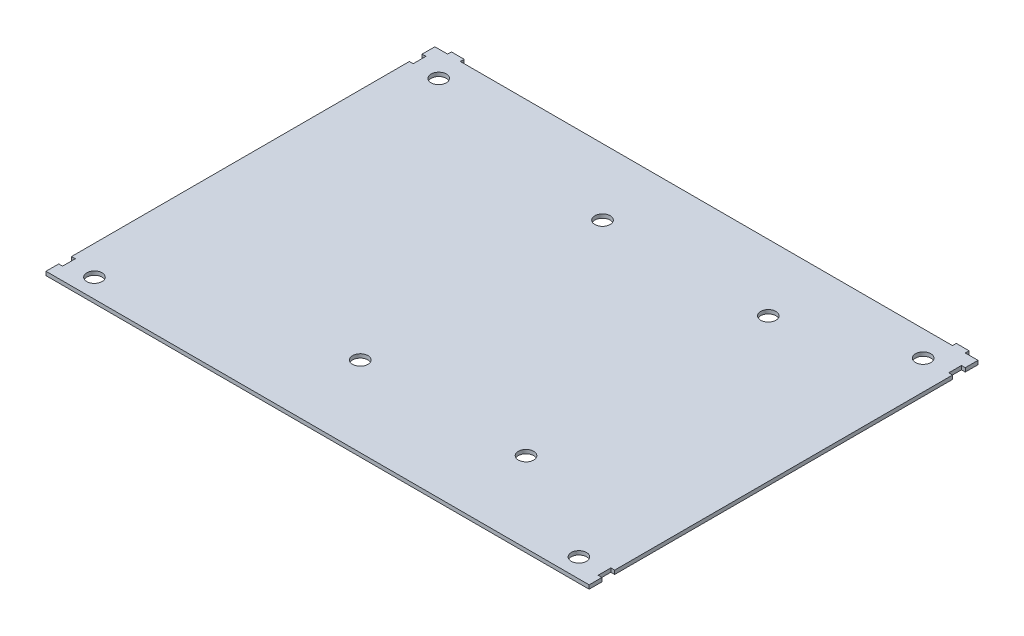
ISO-10303-21;
HEADER;
FILE_DESCRIPTION(('STEP AP214'),'2;1');
FILE_NAME('part.step','',(''),(''),'','','');
FILE_SCHEMA(('AUTOMOTIVE_DESIGN { 1 0 10303 214 1 1 1 1 }'));
ENDSEC;
DATA;
#1=APPLICATION_CONTEXT('core data for automotive mechanical design processes');
#2=APPLICATION_PROTOCOL_DEFINITION('international standard','automotive_design',2000,#1);
#3=PRODUCT_CONTEXT('',#1,'mechanical');
#4=PRODUCT('Part','Part','',(#3));
#5=PRODUCT_RELATED_PRODUCT_CATEGORY('part','',(#4));
#6=PRODUCT_DEFINITION_FORMATION('','',#4);
#7=PRODUCT_DEFINITION_CONTEXT('part definition',#1,'design');
#8=PRODUCT_DEFINITION('design','',#6,#7);
#9=PRODUCT_DEFINITION_SHAPE('','',#8);
#10=(LENGTH_UNIT() NAMED_UNIT(*) SI_UNIT(.MILLI.,.METRE.));
#11=(NAMED_UNIT(*) PLANE_ANGLE_UNIT() SI_UNIT($,.RADIAN.));
#12=(NAMED_UNIT(*) SI_UNIT($,.STERADIAN.) SOLID_ANGLE_UNIT());
#13=UNCERTAINTY_MEASURE_WITH_UNIT(LENGTH_MEASURE(1.E-05),#10,'distance_accuracy_value','');
#14=(GEOMETRIC_REPRESENTATION_CONTEXT(3) GLOBAL_UNCERTAINTY_ASSIGNED_CONTEXT((#13)) GLOBAL_UNIT_ASSIGNED_CONTEXT((#10,
#11,#12)) REPRESENTATION_CONTEXT('',''));
#15=CARTESIAN_POINT('',(0.,0.,0.));
#16=DIRECTION('',(0.,0.,1.));
#17=DIRECTION('',(1.,0.,0.));
#18=AXIS2_PLACEMENT_3D('',#15,#16,#17);
#19=CARTESIAN_POINT('',(214.,0.,-297.));
#20=DIRECTION('',(0.,0.,1.));
#21=DIRECTION('',(1.,0.,0.));
#22=AXIS2_PLACEMENT_3D('',#19,#20,#21);
#23=PLANE('',#22);
#24=DIRECTION('',(1.,0.,0.));
#25=VECTOR('',#24,1.);
#26=CARTESIAN_POINT('',(214.,3.,-297.));
#27=LINE('',#26,#25);
#28=CARTESIAN_POINT('',(214.,3.,-297.));
#29=VERTEX_POINT('',#28);
#30=CARTESIAN_POINT('',(224.,3.,-297.));
#31=VERTEX_POINT('',#30);
#32=EDGE_CURVE('E245',#29,#31,#27,.T.);
#33=ORIENTED_EDGE('',*,*,#32,.T.);
#34=DIRECTION('',(0.,1.,0.));
#35=VECTOR('',#34,1.);
#36=CARTESIAN_POINT('',(224.,-10.4403065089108,-297.));
#37=LINE('',#36,#35);
#38=CARTESIAN_POINT('',(224.,0.,-297.));
#39=VERTEX_POINT('',#38);
#40=EDGE_CURVE('E226',#39,#31,#37,.T.);
#41=ORIENTED_EDGE('',*,*,#40,.F.);
#42=DIRECTION('',(1.,0.,0.));
#43=VECTOR('',#42,1.);
#44=CARTESIAN_POINT('',(214.,0.,-297.));
#45=LINE('',#44,#43);
#46=CARTESIAN_POINT('',(214.,0.,-297.));
#47=VERTEX_POINT('',#46);
#48=EDGE_CURVE('E258',#47,#39,#45,.T.);
#49=ORIENTED_EDGE('',*,*,#48,.F.);
#50=DIRECTION('',(0.,1.,0.));
#51=VECTOR('',#50,1.);
#52=CARTESIAN_POINT('',(214.,0.,-297.));
#53=LINE('',#52,#51);
#54=EDGE_CURVE('E252',#47,#29,#53,.T.);
#55=ORIENTED_EDGE('',*,*,#54,.T.);
#56=EDGE_LOOP('',(#33,#41,#49,#55));
#57=FACE_BOUND('',#56,.T.);
#58=ADVANCED_FACE('F39',(#57),#23,.F.);
#59=CARTESIAN_POINT('',(234.,0.,-297.));
#60=VERTEX_POINT('',#59);
#61=CARTESIAN_POINT('',(620.,0.,-297.));
#62=VERTEX_POINT('',#61);
#63=EDGE_CURVE('E256',#60,#62,#45,.T.);
#64=ORIENTED_EDGE('',*,*,#63,.F.);
#65=DIRECTION('',(0.,1.,0.));
#66=VECTOR('',#65,1.);
#67=CARTESIAN_POINT('',(234.,-10.4403065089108,-297.));
#68=LINE('',#67,#66);
#69=CARTESIAN_POINT('',(234.,3.,-297.));
#70=VERTEX_POINT('',#69);
#71=EDGE_CURVE('E56',#60,#70,#68,.T.);
#72=ORIENTED_EDGE('',*,*,#71,.T.);
#73=CARTESIAN_POINT('',(620.,3.,-297.));
#74=VERTEX_POINT('',#73);
#75=EDGE_CURVE('E253',#70,#74,#27,.T.);
#76=ORIENTED_EDGE('',*,*,#75,.T.);
#77=DIRECTION('',(0.,1.,0.));
#78=VECTOR('',#77,1.);
#79=CARTESIAN_POINT('',(620.,-10.4403065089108,-297.));
#80=LINE('',#79,#78);
#81=EDGE_CURVE('E290',#62,#74,#80,.T.);
#82=ORIENTED_EDGE('',*,*,#81,.F.);
#83=EDGE_LOOP('',(#64,#72,#76,#82));
#84=FACE_BOUND('',#83,.T.);
#85=ADVANCED_FACE('F291',(#84),#23,.F.);
#86=CARTESIAN_POINT('',(214.,429.075110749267,0.));
#87=DIRECTION('',(-1.,0.,0.));
#88=DIRECTION('',(0.,0.,1.));
#89=AXIS2_PLACEMENT_3D('',#86,#87,#88);
#90=PLANE('',#89);
#91=DIRECTION('',(0.,-1.,0.));
#92=VECTOR('',#91,1.);
#93=CARTESIAN_POINT('',(214.,3.,-277.));
#94=LINE('',#93,#92);
#95=CARTESIAN_POINT('',(214.,3.,-277.));
#96=VERTEX_POINT('',#95);
#97=CARTESIAN_POINT('',(214.,0.,-277.));
#98=VERTEX_POINT('',#97);
#99=EDGE_CURVE('E260',#96,#98,#94,.T.);
#100=ORIENTED_EDGE('',*,*,#99,.T.);
#101=DIRECTION('',(0.,0.,-1.));
#102=VECTOR('',#101,1.);
#103=CARTESIAN_POINT('',(214.,0.,0.));
#104=LINE('',#103,#102);
#105=CARTESIAN_POINT('',(214.,0.,-12.));
#106=VERTEX_POINT('',#105);
#107=EDGE_CURVE('E338',#106,#98,#104,.T.);
#108=ORIENTED_EDGE('',*,*,#107,.F.);
#109=DIRECTION('',(0.,1.,0.));
#110=VECTOR('',#109,1.);
#111=CARTESIAN_POINT('',(214.,0.,-12.));
#112=LINE('',#111,#110);
#113=CARTESIAN_POINT('',(214.,3.,-12.));
#114=VERTEX_POINT('',#113);
#115=EDGE_CURVE('E348',#106,#114,#112,.T.);
#116=ORIENTED_EDGE('',*,*,#115,.T.);
#117=DIRECTION('',(0.,0.,-1.));
#118=VECTOR('',#117,1.);
#119=CARTESIAN_POINT('',(214.,3.,0.));
#120=LINE('',#119,#118);
#121=EDGE_CURVE('E356',#114,#96,#120,.T.);
#122=ORIENTED_EDGE('',*,*,#121,.T.);
#123=EDGE_LOOP('',(#100,#108,#116,#122));
#124=FACE_BOUND('',#123,.T.);
#125=ADVANCED_FACE('F487',(#124),#90,.T.);
#126=DIRECTION('',(0.,-1.,0.));
#127=VECTOR('',#126,1.);
#128=CARTESIAN_POINT('',(214.,3.,-287.));
#129=LINE('',#128,#127);
#130=CARTESIAN_POINT('',(214.,3.,-287.));
#131=VERTEX_POINT('',#130);
#132=CARTESIAN_POINT('',(214.,0.,-287.));
#133=VERTEX_POINT('',#132);
#134=EDGE_CURVE('E277',#131,#133,#129,.T.);
#135=ORIENTED_EDGE('',*,*,#134,.F.);
#136=EDGE_CURVE('E357',#131,#29,#120,.T.);
#137=ORIENTED_EDGE('',*,*,#136,.T.);
#138=ORIENTED_EDGE('',*,*,#54,.F.);
#139=EDGE_CURVE('E344',#133,#47,#104,.T.);
#140=ORIENTED_EDGE('',*,*,#139,.F.);
#141=EDGE_LOOP('',(#135,#137,#138,#140));
#142=FACE_BOUND('',#141,.T.);
#143=ADVANCED_FACE('F514',(#142),#90,.T.);
#144=CARTESIAN_POINT('',(640.,-319.530906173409,-300.));
#145=DIRECTION('',(1.,0.,0.));
#146=DIRECTION('',(0.,0.,-1.));
#147=AXIS2_PLACEMENT_3D('',#144,#145,#146);
#148=PLANE('',#147);
#149=DIRECTION('',(0.,-1.,0.));
#150=VECTOR('',#149,1.);
#151=CARTESIAN_POINT('',(640.,3.,-12.));
#152=LINE('',#151,#150);
#153=CARTESIAN_POINT('',(640.,3.,-12.));
#154=VERTEX_POINT('',#153);
#155=CARTESIAN_POINT('',(640.,0.,-12.));
#156=VERTEX_POINT('',#155);
#157=EDGE_CURVE('E383',#154,#156,#152,.T.);
#158=ORIENTED_EDGE('',*,*,#157,.T.);
#159=DIRECTION('',(0.,0.,1.));
#160=VECTOR('',#159,1.);
#161=CARTESIAN_POINT('',(640.,0.,-300.));
#162=LINE('',#161,#160);
#163=CARTESIAN_POINT('',(640.,0.,-277.));
#164=VERTEX_POINT('',#163);
#165=EDGE_CURVE('E48',#164,#156,#162,.T.);
#166=ORIENTED_EDGE('',*,*,#165,.F.);
#167=DIRECTION('',(0.,-1.,0.));
#168=VECTOR('',#167,1.);
#169=CARTESIAN_POINT('',(640.,3.,-277.));
#170=LINE('',#169,#168);
#171=CARTESIAN_POINT('',(640.,3.,-277.));
#172=VERTEX_POINT('',#171);
#173=EDGE_CURVE('E402',#172,#164,#170,.T.);
#174=ORIENTED_EDGE('',*,*,#173,.F.);
#175=DIRECTION('',(0.,0.,-1.));
#176=VECTOR('',#175,1.);
#177=CARTESIAN_POINT('',(640.,3.,-300.));
#178=LINE('',#177,#176);
#179=EDGE_CURVE('E587',#154,#172,#178,.T.);
#180=ORIENTED_EDGE('',*,*,#179,.F.);
#181=EDGE_LOOP('',(#158,#166,#174,#180));
#182=FACE_BOUND('',#181,.T.);
#183=ADVANCED_FACE('F478',(#182),#148,.T.);
#184=DIRECTION('',(0.,1.,0.));
#185=VECTOR('',#184,1.);
#186=CARTESIAN_POINT('',(640.,0.,-297.));
#187=LINE('',#186,#185);
#188=CARTESIAN_POINT('',(640.,0.,-297.));
#189=VERTEX_POINT('',#188);
#190=CARTESIAN_POINT('',(640.,3.,-297.));
#191=VERTEX_POINT('',#190);
#192=EDGE_CURVE('E280',#189,#191,#187,.T.);
#193=ORIENTED_EDGE('',*,*,#192,.T.);
#194=CARTESIAN_POINT('',(640.,3.,-287.));
#195=VERTEX_POINT('',#194);
#196=EDGE_CURVE('E464',#195,#191,#178,.T.);
#197=ORIENTED_EDGE('',*,*,#196,.F.);
#198=DIRECTION('',(0.,-1.,0.));
#199=VECTOR('',#198,1.);
#200=CARTESIAN_POINT('',(640.,3.,-287.));
#201=LINE('',#200,#199);
#202=CARTESIAN_POINT('',(640.,0.,-287.));
#203=VERTEX_POINT('',#202);
#204=EDGE_CURVE('E410',#195,#203,#201,.T.);
#205=ORIENTED_EDGE('',*,*,#204,.T.);
#206=EDGE_CURVE('E11',#189,#203,#162,.T.);
#207=ORIENTED_EDGE('',*,*,#206,.F.);
#208=EDGE_LOOP('',(#193,#197,#205,#207));
#209=FACE_BOUND('',#208,.T.);
#210=ADVANCED_FACE('F471',(#209),#148,.T.);
#211=CARTESIAN_POINT('',(0.,3.,0.));
#212=DIRECTION('',(0.,1.,0.));
#213=DIRECTION('',(0.,0.,1.));
#214=AXIS2_PLACEMENT_3D('',#211,#212,#213);
#215=PLANE('',#214);
#216=DIRECTION('',(-1.,0.,0.));
#217=VECTOR('',#216,1.);
#218=CARTESIAN_POINT('',(214.,3.,-277.));
#219=LINE('',#218,#217);
#220=CARTESIAN_POINT('',(217.,3.,-277.));
#221=VERTEX_POINT('',#220);
#222=EDGE_CURVE('E278',#221,#96,#219,.T.);
#223=ORIENTED_EDGE('',*,*,#222,.T.);
#224=ORIENTED_EDGE('',*,*,#121,.F.);
#225=DIRECTION('',(-1.,0.,0.));
#226=VECTOR('',#225,1.);
#227=CARTESIAN_POINT('',(214.,3.,-12.));
#228=LINE('',#227,#226);
#229=CARTESIAN_POINT('',(217.,3.,-12.));
#230=VERTEX_POINT('',#229);
#231=EDGE_CURVE('E611',#230,#114,#228,.T.);
#232=ORIENTED_EDGE('',*,*,#231,.F.);
#233=DIRECTION('',(0.,0.,-1.));
#234=VECTOR('',#233,1.);
#235=CARTESIAN_POINT('',(217.,3.,-12.));
#236=LINE('',#235,#234);
#237=CARTESIAN_POINT('',(217.,3.,-2.));
#238=VERTEX_POINT('',#237);
#239=EDGE_CURVE('E604',#238,#230,#236,.T.);
#240=ORIENTED_EDGE('',*,*,#239,.F.);
#241=DIRECTION('',(1.,0.,0.));
#242=VECTOR('',#241,1.);
#243=CARTESIAN_POINT('',(214.,3.,-2.));
#244=LINE('',#243,#242);
#245=CARTESIAN_POINT('',(214.,3.,-2.));
#246=VERTEX_POINT('',#245);
#247=EDGE_CURVE('E603',#246,#238,#244,.T.);
#248=ORIENTED_EDGE('',*,*,#247,.F.);
#249=CARTESIAN_POINT('',(214.,3.,8.));
#250=VERTEX_POINT('',#249);
#251=EDGE_CURVE('E352',#250,#246,#120,.T.);
#252=ORIENTED_EDGE('',*,*,#251,.F.);
#253=DIRECTION('',(-1.,0.,0.));
#254=VECTOR('',#253,1.);
#255=CARTESIAN_POINT('',(214.,3.,8.));
#256=LINE('',#255,#254);
#257=CARTESIAN_POINT('',(640.,3.,8.));
#258=VERTEX_POINT('',#257);
#259=EDGE_CURVE('E358',#258,#250,#256,.T.);
#260=ORIENTED_EDGE('',*,*,#259,.F.);
#261=CARTESIAN_POINT('',(640.,3.,-2.));
#262=VERTEX_POINT('',#261);
#263=EDGE_CURVE('E43',#258,#262,#178,.T.);
#264=ORIENTED_EDGE('',*,*,#263,.T.);
#265=DIRECTION('',(-1.,0.,0.));
#266=VECTOR('',#265,1.);
#267=CARTESIAN_POINT('',(640.,3.,-2.));
#268=LINE('',#267,#266);
#269=CARTESIAN_POINT('',(637.,3.,-2.00000000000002));
#270=VERTEX_POINT('',#269);
#271=EDGE_CURVE('E366',#262,#270,#268,.T.);
#272=ORIENTED_EDGE('',*,*,#271,.T.);
#273=DIRECTION('',(0.,0.,-1.));
#274=VECTOR('',#273,1.);
#275=CARTESIAN_POINT('',(637.,3.,-2.00000000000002));
#276=LINE('',#275,#274);
#277=CARTESIAN_POINT('',(637.,3.,-12.));
#278=VERTEX_POINT('',#277);
#279=EDGE_CURVE('E369',#270,#278,#276,.T.);
#280=ORIENTED_EDGE('',*,*,#279,.T.);
#281=DIRECTION('',(1.,0.,0.));
#282=VECTOR('',#281,1.);
#283=CARTESIAN_POINT('',(640.,3.,-12.));
#284=LINE('',#283,#282);
#285=EDGE_CURVE('E373',#278,#154,#284,.T.);
#286=ORIENTED_EDGE('',*,*,#285,.T.);
#287=ORIENTED_EDGE('',*,*,#179,.T.);
#288=DIRECTION('',(-1.,0.,0.));
#289=VECTOR('',#288,1.);
#290=CARTESIAN_POINT('',(640.,3.,-277.));
#291=LINE('',#290,#289);
#292=CARTESIAN_POINT('',(637.,3.,-277.));
#293=VERTEX_POINT('',#292);
#294=EDGE_CURVE('E392',#172,#293,#291,.T.);
#295=ORIENTED_EDGE('',*,*,#294,.T.);
#296=DIRECTION('',(0.,0.,-1.));
#297=VECTOR('',#296,1.);
#298=CARTESIAN_POINT('',(637.,3.,-277.));
#299=LINE('',#298,#297);
#300=CARTESIAN_POINT('',(637.,3.,-287.));
#301=VERTEX_POINT('',#300);
#302=EDGE_CURVE('E395',#293,#301,#299,.T.);
#303=ORIENTED_EDGE('',*,*,#302,.T.);
#304=DIRECTION('',(1.,0.,0.));
#305=VECTOR('',#304,1.);
#306=CARTESIAN_POINT('',(640.,3.,-287.));
#307=LINE('',#306,#305);
#308=EDGE_CURVE('E399',#301,#195,#307,.T.);
#309=ORIENTED_EDGE('',*,*,#308,.T.);
#310=ORIENTED_EDGE('',*,*,#196,.T.);
#311=CARTESIAN_POINT('',(630.,3.,-297.));
#312=VERTEX_POINT('',#311);
#313=EDGE_CURVE('E255',#312,#191,#27,.T.);
#314=ORIENTED_EDGE('',*,*,#313,.F.);
#315=DIRECTION('',(0.,0.,-1.));
#316=VECTOR('',#315,1.);
#317=CARTESIAN_POINT('',(630.,3.,-300.));
#318=LINE('',#317,#316);
#319=CARTESIAN_POINT('',(630.,3.,-300.));
#320=VERTEX_POINT('',#319);
#321=EDGE_CURVE('E314',#312,#320,#318,.T.);
#322=ORIENTED_EDGE('',*,*,#321,.T.);
#323=DIRECTION('',(-1.,0.,0.));
#324=VECTOR('',#323,1.);
#325=CARTESIAN_POINT('',(620.,3.,-300.));
#326=LINE('',#325,#324);
#327=CARTESIAN_POINT('',(620.,3.,-300.));
#328=VERTEX_POINT('',#327);
#329=EDGE_CURVE('E297',#320,#328,#326,.T.);
#330=ORIENTED_EDGE('',*,*,#329,.T.);
#331=DIRECTION('',(0.,0.,1.));
#332=VECTOR('',#331,1.);
#333=CARTESIAN_POINT('',(620.,3.,-300.));
#334=LINE('',#333,#332);
#335=EDGE_CURVE('E312',#328,#74,#334,.T.);
#336=ORIENTED_EDGE('',*,*,#335,.T.);
#337=ORIENTED_EDGE('',*,*,#75,.F.);
#338=DIRECTION('',(0.,0.,-1.));
#339=VECTOR('',#338,1.);
#340=CARTESIAN_POINT('',(234.,3.,-297.));
#341=LINE('',#340,#339);
#342=CARTESIAN_POINT('',(234.,3.,-300.));
#343=VERTEX_POINT('',#342);
#344=EDGE_CURVE('E248',#70,#343,#341,.T.);
#345=ORIENTED_EDGE('',*,*,#344,.T.);
#346=DIRECTION('',(-1.,0.,0.));
#347=VECTOR('',#346,1.);
#348=CARTESIAN_POINT('',(224.,3.,-300.));
#349=LINE('',#348,#347);
#350=CARTESIAN_POINT('',(224.,3.,-300.));
#351=VERTEX_POINT('',#350);
#352=EDGE_CURVE('E237',#343,#351,#349,.T.);
#353=ORIENTED_EDGE('',*,*,#352,.T.);
#354=DIRECTION('',(0.,0.,1.));
#355=VECTOR('',#354,1.);
#356=CARTESIAN_POINT('',(224.,3.,-297.));
#357=LINE('',#356,#355);
#358=EDGE_CURVE('E230',#351,#31,#357,.T.);
#359=ORIENTED_EDGE('',*,*,#358,.T.);
#360=ORIENTED_EDGE('',*,*,#32,.F.);
#361=ORIENTED_EDGE('',*,*,#136,.F.);
#362=DIRECTION('',(1.,0.,0.));
#363=VECTOR('',#362,1.);
#364=CARTESIAN_POINT('',(214.,3.,-287.));
#365=LINE('',#364,#363);
#366=CARTESIAN_POINT('',(217.,3.,-287.));
#367=VERTEX_POINT('',#366);
#368=EDGE_CURVE('E323',#131,#367,#365,.T.);
#369=ORIENTED_EDGE('',*,*,#368,.T.);
#370=DIRECTION('',(0.,0.,1.));
#371=VECTOR('',#370,1.);
#372=CARTESIAN_POINT('',(217.,3.,-277.));
#373=LINE('',#372,#371);
#374=EDGE_CURVE('E326',#367,#221,#373,.T.);
#375=ORIENTED_EDGE('',*,*,#374,.T.);
#376=EDGE_LOOP('',(#223,#224,#232,#240,#248,#252,#260,#264,#272,#280,#286,#287,#295,#303,#309,
#310,#314,#322,#330,#336,#337,#345,#353,#359,#360,#361,#369,#375));
#377=FACE_BOUND('',#376,.T.);
#378=CARTESIAN_POINT('',(617.,3.,-277.));
#379=DIRECTION('',(0.,1.,0.));
#380=DIRECTION('',(0.,0.,1.));
#381=AXIS2_PLACEMENT_3D('',#378,#379,#380);
#382=CIRCLE('',#381,6.00000000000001);
#383=CARTESIAN_POINT('',(617.,3.,-271.));
#384=VERTEX_POINT('',#383);
#385=EDGE_CURVE('E413',#384,#384,#382,.T.);
#386=ORIENTED_EDGE('',*,*,#385,.F.);
#387=EDGE_LOOP('',(#386));
#388=FACE_BOUND('',#387,.T.);
#389=CARTESIAN_POINT('',(617.,3.,-6.9999999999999));
#390=DIRECTION('',(0.,1.,0.));
#391=DIRECTION('',(0.,0.,1.));
#392=AXIS2_PLACEMENT_3D('',#389,#390,#391);
#393=CIRCLE('',#392,6.00000000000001);
#394=CARTESIAN_POINT('',(617.,3.,-0.99999999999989));
#395=VERTEX_POINT('',#394);
#396=EDGE_CURVE('E424',#395,#395,#393,.T.);
#397=ORIENTED_EDGE('',*,*,#396,.F.);
#398=EDGE_LOOP('',(#397));
#399=FACE_BOUND('',#398,.T.);
#400=CARTESIAN_POINT('',(237.,3.,-6.9999999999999));
#401=DIRECTION('',(0.,1.,0.));
#402=DIRECTION('',(0.,0.,1.));
#403=AXIS2_PLACEMENT_3D('',#400,#401,#402);
#404=CIRCLE('',#403,6.00000000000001);
#405=CARTESIAN_POINT('',(237.,3.,-0.99999999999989));
#406=VERTEX_POINT('',#405);
#407=EDGE_CURVE('E430',#406,#406,#404,.T.);
#408=ORIENTED_EDGE('',*,*,#407,.F.);
#409=EDGE_LOOP('',(#408));
#410=FACE_BOUND('',#409,.T.);
#411=CARTESIAN_POINT('',(237.,3.,-277.));
#412=DIRECTION('',(0.,1.,0.));
#413=DIRECTION('',(0.,0.,1.));
#414=AXIS2_PLACEMENT_3D('',#411,#412,#413);
#415=CIRCLE('',#414,6.00000000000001);
#416=CARTESIAN_POINT('',(237.,3.,-271.));
#417=VERTEX_POINT('',#416);
#418=EDGE_CURVE('E436',#417,#417,#415,.T.);
#419=ORIENTED_EDGE('',*,*,#418,.F.);
#420=EDGE_LOOP('',(#419));
#421=FACE_BOUND('',#420,.T.);
#422=CARTESIAN_POINT('',(527.5,3.,-245.));
#423=DIRECTION('',(0.,1.,0.));
#424=DIRECTION('',(0.,0.,1.));
#425=AXIS2_PLACEMENT_3D('',#422,#423,#424);
#426=CIRCLE('',#425,5.99999999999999);
#427=CARTESIAN_POINT('',(527.5,3.,-239.));
#428=VERTEX_POINT('',#427);
#429=EDGE_CURVE('E442',#428,#428,#426,.T.);
#430=ORIENTED_EDGE('',*,*,#429,.F.);
#431=EDGE_LOOP('',(#430));
#432=FACE_BOUND('',#431,.T.);
#433=CARTESIAN_POINT('',(397.5,3.,-55.));
#434=DIRECTION('',(0.,1.,0.));
#435=DIRECTION('',(0.,0.,1.));
#436=AXIS2_PLACEMENT_3D('',#433,#434,#435);
#437=CIRCLE('',#436,5.99999999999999);
#438=CARTESIAN_POINT('',(397.5,3.,-49.));
#439=VERTEX_POINT('',#438);
#440=EDGE_CURVE('E447',#439,#439,#437,.T.);
#441=ORIENTED_EDGE('',*,*,#440,.F.);
#442=EDGE_LOOP('',(#441));
#443=FACE_BOUND('',#442,.T.);
#444=CARTESIAN_POINT('',(397.5,3.,-245.));
#445=DIRECTION('',(0.,1.,0.));
#446=DIRECTION('',(0.,0.,1.));
#447=AXIS2_PLACEMENT_3D('',#444,#445,#446);
#448=CIRCLE('',#447,5.99999999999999);
#449=CARTESIAN_POINT('',(397.5,3.,-239.));
#450=VERTEX_POINT('',#449);
#451=EDGE_CURVE('E446',#450,#450,#448,.T.);
#452=ORIENTED_EDGE('',*,*,#451,.F.);
#453=EDGE_LOOP('',(#452));
#454=FACE_BOUND('',#453,.T.);
#455=CARTESIAN_POINT('',(527.5,3.,-55.));
#456=DIRECTION('',(0.,1.,0.));
#457=DIRECTION('',(0.,0.,1.));
#458=AXIS2_PLACEMENT_3D('',#455,#456,#457);
#459=CIRCLE('',#458,5.99999999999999);
#460=CARTESIAN_POINT('',(527.5,3.,-49.));
#461=VERTEX_POINT('',#460);
#462=EDGE_CURVE('E458',#461,#461,#459,.T.);
#463=ORIENTED_EDGE('',*,*,#462,.F.);
#464=EDGE_LOOP('',(#463));
#465=FACE_BOUND('',#464,.T.);
#466=ADVANCED_FACE('F242',(#377,#388,#399,#410,#421,#432,#443,#454,#465),#215,.T.);
#467=CARTESIAN_POINT('',(0.,0.,0.));
#468=DIRECTION('',(0.,1.,0.));
#469=DIRECTION('',(0.,0.,1.));
#470=AXIS2_PLACEMENT_3D('',#467,#468,#469);
#471=PLANE('',#470);
#472=CARTESIAN_POINT('',(617.,0.,-277.));
#473=DIRECTION('',(0.,1.,0.));
#474=DIRECTION('',(0.,0.,1.));
#475=AXIS2_PLACEMENT_3D('',#472,#473,#474);
#476=CIRCLE('',#475,6.00000000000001);
#477=CARTESIAN_POINT('',(617.,0.,-271.));
#478=VERTEX_POINT('',#477);
#479=EDGE_CURVE('E421',#478,#478,#476,.T.);
#480=ORIENTED_EDGE('',*,*,#479,.T.);
#481=EDGE_LOOP('',(#480));
#482=FACE_BOUND('',#481,.T.);
#483=CARTESIAN_POINT('',(617.,0.,-6.9999999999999));
#484=DIRECTION('',(0.,1.,0.));
#485=DIRECTION('',(0.,0.,1.));
#486=AXIS2_PLACEMENT_3D('',#483,#484,#485);
#487=CIRCLE('',#486,6.00000000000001);
#488=CARTESIAN_POINT('',(617.,0.,-0.99999999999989));
#489=VERTEX_POINT('',#488);
#490=EDGE_CURVE('E427',#489,#489,#487,.T.);
#491=ORIENTED_EDGE('',*,*,#490,.T.);
#492=EDGE_LOOP('',(#491));
#493=FACE_BOUND('',#492,.T.);
#494=CARTESIAN_POINT('',(237.,0.,-6.9999999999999));
#495=DIRECTION('',(0.,1.,0.));
#496=DIRECTION('',(0.,0.,1.));
#497=AXIS2_PLACEMENT_3D('',#494,#495,#496);
#498=CIRCLE('',#497,6.00000000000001);
#499=CARTESIAN_POINT('',(237.,0.,-0.99999999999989));
#500=VERTEX_POINT('',#499);
#501=EDGE_CURVE('E433',#500,#500,#498,.T.);
#502=ORIENTED_EDGE('',*,*,#501,.T.);
#503=EDGE_LOOP('',(#502));
#504=FACE_BOUND('',#503,.T.);
#505=CARTESIAN_POINT('',(237.,0.,-277.));
#506=DIRECTION('',(0.,1.,0.));
#507=DIRECTION('',(0.,0.,1.));
#508=AXIS2_PLACEMENT_3D('',#505,#506,#507);
#509=CIRCLE('',#508,6.00000000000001);
#510=CARTESIAN_POINT('',(237.,0.,-271.));
#511=VERTEX_POINT('',#510);
#512=EDGE_CURVE('E439',#511,#511,#509,.T.);
#513=ORIENTED_EDGE('',*,*,#512,.T.);
#514=EDGE_LOOP('',(#513));
#515=FACE_BOUND('',#514,.T.);
#516=CARTESIAN_POINT('',(527.5,0.,-245.));
#517=DIRECTION('',(0.,1.,0.));
#518=DIRECTION('',(0.,0.,1.));
#519=AXIS2_PLACEMENT_3D('',#516,#517,#518);
#520=CIRCLE('',#519,5.99999999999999);
#521=CARTESIAN_POINT('',(527.5,0.,-239.));
#522=VERTEX_POINT('',#521);
#523=EDGE_CURVE('E450',#522,#522,#520,.T.);
#524=ORIENTED_EDGE('',*,*,#523,.T.);
#525=EDGE_LOOP('',(#524));
#526=FACE_BOUND('',#525,.T.);
#527=CARTESIAN_POINT('',(397.5,0.,-55.));
#528=DIRECTION('',(0.,1.,0.));
#529=DIRECTION('',(0.,0.,1.));
#530=AXIS2_PLACEMENT_3D('',#527,#528,#529);
#531=CIRCLE('',#530,5.99999999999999);
#532=CARTESIAN_POINT('',(397.5,0.,-49.));
#533=VERTEX_POINT('',#532);
#534=EDGE_CURVE('E443',#533,#533,#531,.T.);
#535=ORIENTED_EDGE('',*,*,#534,.T.);
#536=EDGE_LOOP('',(#535));
#537=FACE_BOUND('',#536,.T.);
#538=CARTESIAN_POINT('',(397.5,0.,-245.));
#539=DIRECTION('',(0.,1.,0.));
#540=DIRECTION('',(0.,0.,1.));
#541=AXIS2_PLACEMENT_3D('',#538,#539,#540);
#542=CIRCLE('',#541,5.99999999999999);
#543=CARTESIAN_POINT('',(397.5,0.,-239.));
#544=VERTEX_POINT('',#543);
#545=EDGE_CURVE('E455',#544,#544,#542,.T.);
#546=ORIENTED_EDGE('',*,*,#545,.T.);
#547=EDGE_LOOP('',(#546));
#548=FACE_BOUND('',#547,.T.);
#549=CARTESIAN_POINT('',(527.5,0.,-55.));
#550=DIRECTION('',(0.,1.,0.));
#551=DIRECTION('',(0.,0.,1.));
#552=AXIS2_PLACEMENT_3D('',#549,#550,#551);
#553=CIRCLE('',#552,5.99999999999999);
#554=CARTESIAN_POINT('',(527.5,0.,-49.));
#555=VERTEX_POINT('',#554);
#556=EDGE_CURVE('E461',#555,#555,#553,.T.);
#557=ORIENTED_EDGE('',*,*,#556,.T.);
#558=EDGE_LOOP('',(#557));
#559=FACE_BOUND('',#558,.T.);
#560=ORIENTED_EDGE('',*,*,#107,.T.);
#561=DIRECTION('',(-1.,0.,0.));
#562=VECTOR('',#561,1.);
#563=CARTESIAN_POINT('',(214.,0.,-277.));
#564=LINE('',#563,#562);
#565=CARTESIAN_POINT('',(217.,0.,-277.));
#566=VERTEX_POINT('',#565);
#567=EDGE_CURVE('E273',#566,#98,#564,.T.);
#568=ORIENTED_EDGE('',*,*,#567,.F.);
#569=DIRECTION('',(0.,0.,1.));
#570=VECTOR('',#569,1.);
#571=CARTESIAN_POINT('',(217.,0.,-277.));
#572=LINE('',#571,#570);
#573=CARTESIAN_POINT('',(217.,0.,-287.));
#574=VERTEX_POINT('',#573);
#575=EDGE_CURVE('E306',#574,#566,#572,.T.);
#576=ORIENTED_EDGE('',*,*,#575,.F.);
#577=DIRECTION('',(1.,0.,0.));
#578=VECTOR('',#577,1.);
#579=CARTESIAN_POINT('',(214.,0.,-287.));
#580=LINE('',#579,#578);
#581=EDGE_CURVE('E302',#133,#574,#580,.T.);
#582=ORIENTED_EDGE('',*,*,#581,.F.);
#583=ORIENTED_EDGE('',*,*,#139,.T.);
#584=ORIENTED_EDGE('',*,*,#48,.T.);
#585=DIRECTION('',(0.,0.,-1.));
#586=VECTOR('',#585,1.);
#587=CARTESIAN_POINT('',(224.,0.,-297.));
#588=LINE('',#587,#586);
#589=CARTESIAN_POINT('',(224.,0.,-300.));
#590=VERTEX_POINT('',#589);
#591=EDGE_CURVE('E232',#39,#590,#588,.T.);
#592=ORIENTED_EDGE('',*,*,#591,.T.);
#593=DIRECTION('',(1.,0.,0.));
#594=VECTOR('',#593,1.);
#595=CARTESIAN_POINT('',(224.,0.,-300.));
#596=LINE('',#595,#594);
#597=CARTESIAN_POINT('',(234.,0.,-300.));
#598=VERTEX_POINT('',#597);
#599=EDGE_CURVE('E654',#590,#598,#596,.T.);
#600=ORIENTED_EDGE('',*,*,#599,.T.);
#601=DIRECTION('',(0.,0.,1.));
#602=VECTOR('',#601,1.);
#603=CARTESIAN_POINT('',(234.,0.,-297.));
#604=LINE('',#603,#602);
#605=EDGE_CURVE('E287',#598,#60,#604,.T.);
#606=ORIENTED_EDGE('',*,*,#605,.T.);
#607=ORIENTED_EDGE('',*,*,#63,.T.);
#608=DIRECTION('',(0.,0.,-1.));
#609=VECTOR('',#608,1.);
#610=CARTESIAN_POINT('',(620.,0.,-300.));
#611=LINE('',#610,#609);
#612=CARTESIAN_POINT('',(620.,0.,-300.));
#613=VERTEX_POINT('',#612);
#614=EDGE_CURVE('E285',#62,#613,#611,.T.);
#615=ORIENTED_EDGE('',*,*,#614,.T.);
#616=DIRECTION('',(1.,0.,0.));
#617=VECTOR('',#616,1.);
#618=CARTESIAN_POINT('',(620.,0.,-300.));
#619=LINE('',#618,#617);
#620=CARTESIAN_POINT('',(630.,0.,-300.));
#621=VERTEX_POINT('',#620);
#622=EDGE_CURVE('E303',#613,#621,#619,.T.);
#623=ORIENTED_EDGE('',*,*,#622,.T.);
#624=DIRECTION('',(0.,0.,1.));
#625=VECTOR('',#624,1.);
#626=CARTESIAN_POINT('',(630.,0.,-300.));
#627=LINE('',#626,#625);
#628=CARTESIAN_POINT('',(630.,0.,-297.));
#629=VERTEX_POINT('',#628);
#630=EDGE_CURVE('E308',#621,#629,#627,.T.);
#631=ORIENTED_EDGE('',*,*,#630,.T.);
#632=EDGE_CURVE('E64',#629,#189,#45,.T.);
#633=ORIENTED_EDGE('',*,*,#632,.T.);
#634=ORIENTED_EDGE('',*,*,#206,.T.);
#635=DIRECTION('',(1.,0.,0.));
#636=VECTOR('',#635,1.);
#637=CARTESIAN_POINT('',(640.,0.,-287.));
#638=LINE('',#637,#636);
#639=CARTESIAN_POINT('',(637.,0.,-287.));
#640=VERTEX_POINT('',#639);
#641=EDGE_CURVE('E396',#640,#203,#638,.T.);
#642=ORIENTED_EDGE('',*,*,#641,.F.);
#643=DIRECTION('',(0.,0.,-1.));
#644=VECTOR('',#643,1.);
#645=CARTESIAN_POINT('',(637.,0.,-277.));
#646=LINE('',#645,#644);
#647=CARTESIAN_POINT('',(637.,0.,-277.));
#648=VERTEX_POINT('',#647);
#649=EDGE_CURVE('E405',#648,#640,#646,.T.);
#650=ORIENTED_EDGE('',*,*,#649,.F.);
#651=DIRECTION('',(-1.,0.,0.));
#652=VECTOR('',#651,1.);
#653=CARTESIAN_POINT('',(640.,0.,-277.));
#654=LINE('',#653,#652);
#655=EDGE_CURVE('E386',#164,#648,#654,.T.);
#656=ORIENTED_EDGE('',*,*,#655,.F.);
#657=ORIENTED_EDGE('',*,*,#165,.T.);
#658=DIRECTION('',(1.,0.,0.));
#659=VECTOR('',#658,1.);
#660=CARTESIAN_POINT('',(640.,0.,-12.));
#661=LINE('',#660,#659);
#662=CARTESIAN_POINT('',(637.,0.,-12.));
#663=VERTEX_POINT('',#662);
#664=EDGE_CURVE('E370',#663,#156,#661,.T.);
#665=ORIENTED_EDGE('',*,*,#664,.F.);
#666=DIRECTION('',(0.,0.,-1.));
#667=VECTOR('',#666,1.);
#668=CARTESIAN_POINT('',(637.,0.,-2.00000000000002));
#669=LINE('',#668,#667);
#670=CARTESIAN_POINT('',(637.,0.,-2.00000000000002));
#671=VERTEX_POINT('',#670);
#672=EDGE_CURVE('E379',#671,#663,#669,.T.);
#673=ORIENTED_EDGE('',*,*,#672,.F.);
#674=DIRECTION('',(-1.,0.,0.));
#675=VECTOR('',#674,1.);
#676=CARTESIAN_POINT('',(640.,0.,-2.));
#677=LINE('',#676,#675);
#678=CARTESIAN_POINT('',(640.,0.,-2.));
#679=VERTEX_POINT('',#678);
#680=EDGE_CURVE('E355',#679,#671,#677,.T.);
#681=ORIENTED_EDGE('',*,*,#680,.F.);
#682=CARTESIAN_POINT('',(640.,0.,8.));
#683=VERTEX_POINT('',#682);
#684=EDGE_CURVE('E49',#679,#683,#162,.T.);
#685=ORIENTED_EDGE('',*,*,#684,.T.);
#686=DIRECTION('',(-1.,0.,0.));
#687=VECTOR('',#686,1.);
#688=CARTESIAN_POINT('',(214.,0.,8.));
#689=LINE('',#688,#687);
#690=CARTESIAN_POINT('',(214.,0.,8.));
#691=VERTEX_POINT('',#690);
#692=EDGE_CURVE('E347',#683,#691,#689,.T.);
#693=ORIENTED_EDGE('',*,*,#692,.T.);
#694=CARTESIAN_POINT('',(214.,0.,-2.));
#695=VERTEX_POINT('',#694);
#696=EDGE_CURVE('E343',#691,#695,#104,.T.);
#697=ORIENTED_EDGE('',*,*,#696,.T.);
#698=DIRECTION('',(1.,0.,0.));
#699=VECTOR('',#698,1.);
#700=CARTESIAN_POINT('',(214.,0.,-2.));
#701=LINE('',#700,#699);
#702=CARTESIAN_POINT('',(217.,0.,-2.));
#703=VERTEX_POINT('',#702);
#704=EDGE_CURVE('E607',#695,#703,#701,.T.);
#705=ORIENTED_EDGE('',*,*,#704,.T.);
#706=DIRECTION('',(0.,0.,-1.));
#707=VECTOR('',#706,1.);
#708=CARTESIAN_POINT('',(217.,0.,-12.));
#709=LINE('',#708,#707);
#710=CARTESIAN_POINT('',(217.,0.,-12.));
#711=VERTEX_POINT('',#710);
#712=EDGE_CURVE('E610',#703,#711,#709,.T.);
#713=ORIENTED_EDGE('',*,*,#712,.T.);
#714=DIRECTION('',(-1.,0.,0.));
#715=VECTOR('',#714,1.);
#716=CARTESIAN_POINT('',(214.,0.,-12.));
#717=LINE('',#716,#715);
#718=EDGE_CURVE('E341',#711,#106,#717,.T.);
#719=ORIENTED_EDGE('',*,*,#718,.T.);
#720=EDGE_LOOP('',(#560,#568,#576,#582,#583,#584,#592,#600,#606,#607,#615,#623,#631,#633,#634,
#642,#650,#656,#657,#665,#673,#681,#685,#693,#697,#705,#713,#719));
#721=FACE_BOUND('',#720,.T.);
#722=ADVANCED_FACE('F41',(#482,#493,#504,#515,#526,#537,#548,#559,#721),#471,.F.);
#723=DIRECTION('',(0.,-1.,0.));
#724=VECTOR('',#723,1.);
#725=CARTESIAN_POINT('',(640.,3.,-2.));
#726=LINE('',#725,#724);
#727=EDGE_CURVE('E376',#262,#679,#726,.T.);
#728=ORIENTED_EDGE('',*,*,#727,.F.);
#729=ORIENTED_EDGE('',*,*,#263,.F.);
#730=DIRECTION('',(0.,-1.,0.));
#731=VECTOR('',#730,1.);
#732=CARTESIAN_POINT('',(640.,429.075110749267,8.));
#733=LINE('',#732,#731);
#734=EDGE_CURVE('E362',#258,#683,#733,.T.);
#735=ORIENTED_EDGE('',*,*,#734,.T.);
#736=ORIENTED_EDGE('',*,*,#684,.F.);
#737=EDGE_LOOP('',(#728,#729,#735,#736));
#738=FACE_BOUND('',#737,.T.);
#739=ADVANCED_FACE('F476',(#738),#148,.T.);
#740=CARTESIAN_POINT('',(527.5,0.,-55.));
#741=DIRECTION('',(0.,1.,0.));
#742=DIRECTION('',(0.,0.,1.));
#743=AXIS2_PLACEMENT_3D('',#740,#741,#742);
#744=CYLINDRICAL_SURFACE('',#743,5.99999999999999);
#745=ORIENTED_EDGE('',*,*,#556,.F.);
#746=EDGE_LOOP('',(#745));
#747=FACE_BOUND('',#746,.T.);
#748=ORIENTED_EDGE('',*,*,#462,.T.);
#749=EDGE_LOOP('',(#748));
#750=FACE_BOUND('',#749,.T.);
#751=ADVANCED_FACE('F468',(#747,#750),#744,.F.);
#752=CARTESIAN_POINT('',(397.5,0.,-245.));
#753=DIRECTION('',(0.,1.,0.));
#754=DIRECTION('',(0.,0.,1.));
#755=AXIS2_PLACEMENT_3D('',#752,#753,#754);
#756=CYLINDRICAL_SURFACE('',#755,5.99999999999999);
#757=ORIENTED_EDGE('',*,*,#545,.F.);
#758=EDGE_LOOP('',(#757));
#759=FACE_BOUND('',#758,.T.);
#760=ORIENTED_EDGE('',*,*,#451,.T.);
#761=EDGE_LOOP('',(#760));
#762=FACE_BOUND('',#761,.T.);
#763=ADVANCED_FACE('F562',(#759,#762),#756,.F.);
#764=CARTESIAN_POINT('',(397.5,0.,-55.));
#765=DIRECTION('',(0.,1.,0.));
#766=DIRECTION('',(0.,0.,1.));
#767=AXIS2_PLACEMENT_3D('',#764,#765,#766);
#768=CYLINDRICAL_SURFACE('',#767,5.99999999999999);
#769=ORIENTED_EDGE('',*,*,#534,.F.);
#770=EDGE_LOOP('',(#769));
#771=FACE_BOUND('',#770,.T.);
#772=ORIENTED_EDGE('',*,*,#440,.T.);
#773=EDGE_LOOP('',(#772));
#774=FACE_BOUND('',#773,.T.);
#775=ADVANCED_FACE('F559',(#771,#774),#768,.F.);
#776=CARTESIAN_POINT('',(527.5,0.,-245.));
#777=DIRECTION('',(0.,1.,0.));
#778=DIRECTION('',(0.,0.,1.));
#779=AXIS2_PLACEMENT_3D('',#776,#777,#778);
#780=CYLINDRICAL_SURFACE('',#779,5.99999999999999);
#781=ORIENTED_EDGE('',*,*,#523,.F.);
#782=EDGE_LOOP('',(#781));
#783=FACE_BOUND('',#782,.T.);
#784=ORIENTED_EDGE('',*,*,#429,.T.);
#785=EDGE_LOOP('',(#784));
#786=FACE_BOUND('',#785,.T.);
#787=ADVANCED_FACE('F557',(#783,#786),#780,.F.);
#788=CARTESIAN_POINT('',(237.,3.,-277.));
#789=DIRECTION('',(0.,1.,0.));
#790=DIRECTION('',(0.,0.,1.));
#791=AXIS2_PLACEMENT_3D('',#788,#789,#790);
#792=CYLINDRICAL_SURFACE('',#791,6.00000000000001);
#793=ORIENTED_EDGE('',*,*,#512,.F.);
#794=EDGE_LOOP('',(#793));
#795=FACE_BOUND('',#794,.T.);
#796=ORIENTED_EDGE('',*,*,#418,.T.);
#797=EDGE_LOOP('',(#796));
#798=FACE_BOUND('',#797,.T.);
#799=ADVANCED_FACE('F553',(#795,#798),#792,.F.);
#800=CARTESIAN_POINT('',(237.,3.,-6.9999999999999));
#801=DIRECTION('',(0.,1.,0.));
#802=DIRECTION('',(0.,0.,1.));
#803=AXIS2_PLACEMENT_3D('',#800,#801,#802);
#804=CYLINDRICAL_SURFACE('',#803,6.00000000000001);
#805=ORIENTED_EDGE('',*,*,#501,.F.);
#806=EDGE_LOOP('',(#805));
#807=FACE_BOUND('',#806,.T.);
#808=ORIENTED_EDGE('',*,*,#407,.T.);
#809=EDGE_LOOP('',(#808));
#810=FACE_BOUND('',#809,.T.);
#811=ADVANCED_FACE('F549',(#807,#810),#804,.F.);
#812=CARTESIAN_POINT('',(617.,3.,-6.9999999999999));
#813=DIRECTION('',(0.,1.,0.));
#814=DIRECTION('',(0.,0.,1.));
#815=AXIS2_PLACEMENT_3D('',#812,#813,#814);
#816=CYLINDRICAL_SURFACE('',#815,6.00000000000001);
#817=ORIENTED_EDGE('',*,*,#490,.F.);
#818=EDGE_LOOP('',(#817));
#819=FACE_BOUND('',#818,.T.);
#820=ORIENTED_EDGE('',*,*,#396,.T.);
#821=EDGE_LOOP('',(#820));
#822=FACE_BOUND('',#821,.T.);
#823=ADVANCED_FACE('F545',(#819,#822),#816,.F.);
#824=CARTESIAN_POINT('',(617.,3.,-277.));
#825=DIRECTION('',(0.,1.,0.));
#826=DIRECTION('',(0.,0.,1.));
#827=AXIS2_PLACEMENT_3D('',#824,#825,#826);
#828=CYLINDRICAL_SURFACE('',#827,6.00000000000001);
#829=ORIENTED_EDGE('',*,*,#479,.F.);
#830=EDGE_LOOP('',(#829));
#831=FACE_BOUND('',#830,.T.);
#832=ORIENTED_EDGE('',*,*,#385,.T.);
#833=EDGE_LOOP('',(#832));
#834=FACE_BOUND('',#833,.T.);
#835=ADVANCED_FACE('F535',(#831,#834),#828,.F.);
#836=CARTESIAN_POINT('',(640.,3.,-287.));
#837=DIRECTION('',(0.,0.,-1.));
#838=DIRECTION('',(-1.,0.,0.));
#839=AXIS2_PLACEMENT_3D('',#836,#837,#838);
#840=PLANE('',#839);
#841=ORIENTED_EDGE('',*,*,#641,.T.);
#842=ORIENTED_EDGE('',*,*,#204,.F.);
#843=ORIENTED_EDGE('',*,*,#308,.F.);
#844=DIRECTION('',(0.,-1.,0.));
#845=VECTOR('',#844,1.);
#846=CARTESIAN_POINT('',(637.,3.,-287.));
#847=LINE('',#846,#845);
#848=EDGE_CURVE('E414',#301,#640,#847,.T.);
#849=ORIENTED_EDGE('',*,*,#848,.T.);
#850=EDGE_LOOP('',(#841,#842,#843,#849));
#851=FACE_BOUND('',#850,.T.);
#852=ADVANCED_FACE('F531',(#851),#840,.F.);
#853=CARTESIAN_POINT('',(637.,3.,-277.));
#854=DIRECTION('',(-1.,0.,0.));
#855=DIRECTION('',(0.,0.,1.));
#856=AXIS2_PLACEMENT_3D('',#853,#854,#855);
#857=PLANE('',#856);
#858=ORIENTED_EDGE('',*,*,#649,.T.);
#859=ORIENTED_EDGE('',*,*,#848,.F.);
#860=ORIENTED_EDGE('',*,*,#302,.F.);
#861=DIRECTION('',(0.,-1.,0.));
#862=VECTOR('',#861,1.);
#863=CARTESIAN_POINT('',(637.,3.,-277.));
#864=LINE('',#863,#862);
#865=EDGE_CURVE('E416',#293,#648,#864,.T.);
#866=ORIENTED_EDGE('',*,*,#865,.T.);
#867=EDGE_LOOP('',(#858,#859,#860,#866));
#868=FACE_BOUND('',#867,.T.);
#869=ADVANCED_FACE('F534',(#868),#857,.F.);
#870=CARTESIAN_POINT('',(640.,3.,-277.));
#871=DIRECTION('',(0.,0.,1.));
#872=DIRECTION('',(1.,0.,0.));
#873=AXIS2_PLACEMENT_3D('',#870,#871,#872);
#874=PLANE('',#873);
#875=ORIENTED_EDGE('',*,*,#655,.T.);
#876=ORIENTED_EDGE('',*,*,#865,.F.);
#877=ORIENTED_EDGE('',*,*,#294,.F.);
#878=ORIENTED_EDGE('',*,*,#173,.T.);
#879=EDGE_LOOP('',(#875,#876,#877,#878));
#880=FACE_BOUND('',#879,.T.);
#881=ADVANCED_FACE('F523',(#880),#874,.F.);
#882=CARTESIAN_POINT('',(640.,3.,-12.));
#883=DIRECTION('',(0.,0.,-1.));
#884=DIRECTION('',(-1.,0.,0.));
#885=AXIS2_PLACEMENT_3D('',#882,#883,#884);
#886=PLANE('',#885);
#887=ORIENTED_EDGE('',*,*,#664,.T.);
#888=ORIENTED_EDGE('',*,*,#157,.F.);
#889=ORIENTED_EDGE('',*,*,#285,.F.);
#890=DIRECTION('',(0.,-1.,0.));
#891=VECTOR('',#890,1.);
#892=CARTESIAN_POINT('',(637.,3.,-12.));
#893=LINE('',#892,#891);
#894=EDGE_CURVE('E387',#278,#663,#893,.T.);
#895=ORIENTED_EDGE('',*,*,#894,.T.);
#896=EDGE_LOOP('',(#887,#888,#889,#895));
#897=FACE_BOUND('',#896,.T.);
#898=ADVANCED_FACE('F519',(#897),#886,.F.);
#899=CARTESIAN_POINT('',(637.,3.,-2.00000000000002));
#900=DIRECTION('',(-1.,0.,0.));
#901=DIRECTION('',(0.,0.,1.));
#902=AXIS2_PLACEMENT_3D('',#899,#900,#901);
#903=PLANE('',#902);
#904=ORIENTED_EDGE('',*,*,#672,.T.);
#905=ORIENTED_EDGE('',*,*,#894,.F.);
#906=ORIENTED_EDGE('',*,*,#279,.F.);
#907=DIRECTION('',(0.,-1.,0.));
#908=VECTOR('',#907,1.);
#909=CARTESIAN_POINT('',(637.,3.,-2.00000000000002));
#910=LINE('',#909,#908);
#911=EDGE_CURVE('E389',#270,#671,#910,.T.);
#912=ORIENTED_EDGE('',*,*,#911,.T.);
#913=EDGE_LOOP('',(#904,#905,#906,#912));
#914=FACE_BOUND('',#913,.T.);
#915=ADVANCED_FACE('F522',(#914),#903,.F.);
#916=CARTESIAN_POINT('',(640.,3.,-2.));
#917=DIRECTION('',(0.,0.,1.));
#918=DIRECTION('',(1.,0.,0.));
#919=AXIS2_PLACEMENT_3D('',#916,#917,#918);
#920=PLANE('',#919);
#921=ORIENTED_EDGE('',*,*,#680,.T.);
#922=ORIENTED_EDGE('',*,*,#911,.F.);
#923=ORIENTED_EDGE('',*,*,#271,.F.);
#924=ORIENTED_EDGE('',*,*,#727,.T.);
#925=EDGE_LOOP('',(#921,#922,#923,#924));
#926=FACE_BOUND('',#925,.T.);
#927=ADVANCED_FACE('F517',(#926),#920,.F.);
#928=CARTESIAN_POINT('',(214.,429.075110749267,8.));
#929=DIRECTION('',(0.,0.,1.));
#930=DIRECTION('',(1.,0.,0.));
#931=AXIS2_PLACEMENT_3D('',#928,#929,#930);
#932=PLANE('',#931);
#933=ORIENTED_EDGE('',*,*,#734,.F.);
#934=ORIENTED_EDGE('',*,*,#259,.T.);
#935=DIRECTION('',(0.,-1.,0.));
#936=VECTOR('',#935,1.);
#937=CARTESIAN_POINT('',(214.,429.075110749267,8.));
#938=LINE('',#937,#936);
#939=EDGE_CURVE('E361',#250,#691,#938,.T.);
#940=ORIENTED_EDGE('',*,*,#939,.T.);
#941=ORIENTED_EDGE('',*,*,#692,.F.);
#942=EDGE_LOOP('',(#933,#934,#940,#941));
#943=FACE_BOUND('',#942,.T.);
#944=ADVANCED_FACE('F512',(#943),#932,.T.);
#945=DIRECTION('',(0.,1.,0.));
#946=VECTOR('',#945,1.);
#947=CARTESIAN_POINT('',(214.,0.,-2.));
#948=LINE('',#947,#946);
#949=EDGE_CURVE('E613',#695,#246,#948,.T.);
#950=ORIENTED_EDGE('',*,*,#949,.F.);
#951=ORIENTED_EDGE('',*,*,#696,.F.);
#952=ORIENTED_EDGE('',*,*,#939,.F.);
#953=ORIENTED_EDGE('',*,*,#251,.T.);
#954=EDGE_LOOP('',(#950,#951,#952,#953));
#955=FACE_BOUND('',#954,.T.);
#956=ADVANCED_FACE('F509',(#955),#90,.T.);
#957=CARTESIAN_POINT('',(214.,0.,-12.));
#958=DIRECTION('',(0.,0.,-1.));
#959=DIRECTION('',(-1.,0.,0.));
#960=AXIS2_PLACEMENT_3D('',#957,#958,#959);
#961=PLANE('',#960);
#962=ORIENTED_EDGE('',*,*,#231,.T.);
#963=ORIENTED_EDGE('',*,*,#115,.F.);
#964=ORIENTED_EDGE('',*,*,#718,.F.);
#965=DIRECTION('',(0.,1.,0.));
#966=VECTOR('',#965,1.);
#967=CARTESIAN_POINT('',(217.,0.,-12.));
#968=LINE('',#967,#966);
#969=EDGE_CURVE('E619',#711,#230,#968,.T.);
#970=ORIENTED_EDGE('',*,*,#969,.T.);
#971=EDGE_LOOP('',(#962,#963,#964,#970));
#972=FACE_BOUND('',#971,.T.);
#973=ADVANCED_FACE('F504',(#972),#961,.F.);
#974=CARTESIAN_POINT('',(217.,0.,-12.));
#975=DIRECTION('',(1.,0.,0.));
#976=DIRECTION('',(0.,0.,-1.));
#977=AXIS2_PLACEMENT_3D('',#974,#975,#976);
#978=PLANE('',#977);
#979=ORIENTED_EDGE('',*,*,#239,.T.);
#980=ORIENTED_EDGE('',*,*,#969,.F.);
#981=ORIENTED_EDGE('',*,*,#712,.F.);
#982=DIRECTION('',(0.,1.,0.));
#983=VECTOR('',#982,1.);
#984=CARTESIAN_POINT('',(217.,0.,-2.));
#985=LINE('',#984,#983);
#986=EDGE_CURVE('E621',#703,#238,#985,.T.);
#987=ORIENTED_EDGE('',*,*,#986,.T.);
#988=EDGE_LOOP('',(#979,#980,#981,#987));
#989=FACE_BOUND('',#988,.T.);
#990=ADVANCED_FACE('F498',(#989),#978,.F.);
#991=CARTESIAN_POINT('',(214.,0.,-2.));
#992=DIRECTION('',(0.,0.,1.));
#993=DIRECTION('',(1.,0.,0.));
#994=AXIS2_PLACEMENT_3D('',#991,#992,#993);
#995=PLANE('',#994);
#996=ORIENTED_EDGE('',*,*,#247,.T.);
#997=ORIENTED_EDGE('',*,*,#986,.F.);
#998=ORIENTED_EDGE('',*,*,#704,.F.);
#999=ORIENTED_EDGE('',*,*,#949,.T.);
#1000=EDGE_LOOP('',(#996,#997,#998,#999));
#1001=FACE_BOUND('',#1000,.T.);
#1002=ADVANCED_FACE('F491',(#1001),#995,.F.);
#1003=ORIENTED_EDGE('',*,*,#632,.F.);
#1004=DIRECTION('',(0.,1.,0.));
#1005=VECTOR('',#1004,1.);
#1006=CARTESIAN_POINT('',(630.,-10.4403065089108,-297.));
#1007=LINE('',#1006,#1005);
#1008=EDGE_CURVE('E296',#629,#312,#1007,.T.);
#1009=ORIENTED_EDGE('',*,*,#1008,.T.);
#1010=ORIENTED_EDGE('',*,*,#313,.T.);
#1011=ORIENTED_EDGE('',*,*,#192,.F.);
#1012=EDGE_LOOP('',(#1003,#1009,#1010,#1011));
#1013=FACE_BOUND('',#1012,.T.);
#1014=ADVANCED_FACE('F483',(#1013),#23,.F.);
#1015=CARTESIAN_POINT('',(214.,3.,-277.));
#1016=DIRECTION('',(0.,0.,1.));
#1017=DIRECTION('',(1.,0.,0.));
#1018=AXIS2_PLACEMENT_3D('',#1015,#1016,#1017);
#1019=PLANE('',#1018);
#1020=ORIENTED_EDGE('',*,*,#567,.T.);
#1021=ORIENTED_EDGE('',*,*,#99,.F.);
#1022=ORIENTED_EDGE('',*,*,#222,.F.);
#1023=DIRECTION('',(0.,-1.,0.));
#1024=VECTOR('',#1023,1.);
#1025=CARTESIAN_POINT('',(217.,3.,-277.));
#1026=LINE('',#1025,#1024);
#1027=EDGE_CURVE('E264',#221,#566,#1026,.T.);
#1028=ORIENTED_EDGE('',*,*,#1027,.T.);
#1029=EDGE_LOOP('',(#1020,#1021,#1022,#1028));
#1030=FACE_BOUND('',#1029,.T.);
#1031=ADVANCED_FACE('F334',(#1030),#1019,.F.);
#1032=CARTESIAN_POINT('',(217.,3.,-277.));
#1033=DIRECTION('',(1.,0.,0.));
#1034=DIRECTION('',(0.,0.,-1.));
#1035=AXIS2_PLACEMENT_3D('',#1032,#1033,#1034);
#1036=PLANE('',#1035);
#1037=ORIENTED_EDGE('',*,*,#575,.T.);
#1038=ORIENTED_EDGE('',*,*,#1027,.F.);
#1039=ORIENTED_EDGE('',*,*,#374,.F.);
#1040=DIRECTION('',(0.,-1.,0.));
#1041=VECTOR('',#1040,1.);
#1042=CARTESIAN_POINT('',(217.,3.,-287.));
#1043=LINE('',#1042,#1041);
#1044=EDGE_CURVE('E270',#367,#574,#1043,.T.);
#1045=ORIENTED_EDGE('',*,*,#1044,.T.);
#1046=EDGE_LOOP('',(#1037,#1038,#1039,#1045));
#1047=FACE_BOUND('',#1046,.T.);
#1048=ADVANCED_FACE('F496',(#1047),#1036,.F.);
#1049=CARTESIAN_POINT('',(214.,3.,-287.));
#1050=DIRECTION('',(0.,0.,-1.));
#1051=DIRECTION('',(-1.,0.,0.));
#1052=AXIS2_PLACEMENT_3D('',#1049,#1050,#1051);
#1053=PLANE('',#1052);
#1054=ORIENTED_EDGE('',*,*,#581,.T.);
#1055=ORIENTED_EDGE('',*,*,#1044,.F.);
#1056=ORIENTED_EDGE('',*,*,#368,.F.);
#1057=ORIENTED_EDGE('',*,*,#134,.T.);
#1058=EDGE_LOOP('',(#1054,#1055,#1056,#1057));
#1059=FACE_BOUND('',#1058,.T.);
#1060=ADVANCED_FACE('F672',(#1059),#1053,.F.);
#1061=CARTESIAN_POINT('',(620.,-10.4403065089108,-300.));
#1062=DIRECTION('',(-1.,0.,0.));
#1063=DIRECTION('',(0.,0.,1.));
#1064=AXIS2_PLACEMENT_3D('',#1061,#1062,#1063);
#1065=PLANE('',#1064);
#1066=ORIENTED_EDGE('',*,*,#614,.F.);
#1067=ORIENTED_EDGE('',*,*,#81,.T.);
#1068=ORIENTED_EDGE('',*,*,#335,.F.);
#1069=DIRECTION('',(0.,1.,0.));
#1070=VECTOR('',#1069,1.);
#1071=CARTESIAN_POINT('',(620.,-10.4403065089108,-300.));
#1072=LINE('',#1071,#1070);
#1073=EDGE_CURVE('E301',#613,#328,#1072,.T.);
#1074=ORIENTED_EDGE('',*,*,#1073,.F.);
#1075=EDGE_LOOP('',(#1066,#1067,#1068,#1074));
#1076=FACE_BOUND('',#1075,.T.);
#1077=ADVANCED_FACE('F300',(#1076),#1065,.T.);
#1078=CARTESIAN_POINT('',(620.,-10.4403065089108,-300.));
#1079=DIRECTION('',(0.,0.,-1.));
#1080=DIRECTION('',(-1.,0.,0.));
#1081=AXIS2_PLACEMENT_3D('',#1078,#1079,#1080);
#1082=PLANE('',#1081);
#1083=ORIENTED_EDGE('',*,*,#622,.F.);
#1084=ORIENTED_EDGE('',*,*,#1073,.T.);
#1085=ORIENTED_EDGE('',*,*,#329,.F.);
#1086=DIRECTION('',(0.,1.,0.));
#1087=VECTOR('',#1086,1.);
#1088=CARTESIAN_POINT('',(630.,-10.4403065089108,-300.));
#1089=LINE('',#1088,#1087);
#1090=EDGE_CURVE('E320',#621,#320,#1089,.T.);
#1091=ORIENTED_EDGE('',*,*,#1090,.F.);
#1092=EDGE_LOOP('',(#1083,#1084,#1085,#1091));
#1093=FACE_BOUND('',#1092,.T.);
#1094=ADVANCED_FACE('F641',(#1093),#1082,.T.);
#1095=CARTESIAN_POINT('',(630.,-10.4403065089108,-300.));
#1096=DIRECTION('',(1.,0.,0.));
#1097=DIRECTION('',(0.,0.,-1.));
#1098=AXIS2_PLACEMENT_3D('',#1095,#1096,#1097);
#1099=PLANE('',#1098);
#1100=ORIENTED_EDGE('',*,*,#630,.F.);
#1101=ORIENTED_EDGE('',*,*,#1090,.T.);
#1102=ORIENTED_EDGE('',*,*,#321,.F.);
#1103=ORIENTED_EDGE('',*,*,#1008,.F.);
#1104=EDGE_LOOP('',(#1100,#1101,#1102,#1103));
#1105=FACE_BOUND('',#1104,.T.);
#1106=ADVANCED_FACE('F638',(#1105),#1099,.T.);
#1107=CARTESIAN_POINT('',(224.,-10.4403065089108,-297.));
#1108=DIRECTION('',(-1.,0.,0.));
#1109=DIRECTION('',(0.,0.,1.));
#1110=AXIS2_PLACEMENT_3D('',#1107,#1108,#1109);
#1111=PLANE('',#1110);
#1112=ORIENTED_EDGE('',*,*,#591,.F.);
#1113=ORIENTED_EDGE('',*,*,#40,.T.);
#1114=ORIENTED_EDGE('',*,*,#358,.F.);
#1115=DIRECTION('',(0.,1.,0.));
#1116=VECTOR('',#1115,1.);
#1117=CARTESIAN_POINT('',(224.,-10.4403065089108,-300.));
#1118=LINE('',#1117,#1116);
#1119=EDGE_CURVE('E648',#590,#351,#1118,.T.);
#1120=ORIENTED_EDGE('',*,*,#1119,.F.);
#1121=EDGE_LOOP('',(#1112,#1113,#1114,#1120));
#1122=FACE_BOUND('',#1121,.T.);
#1123=ADVANCED_FACE('F228',(#1122),#1111,.T.);
#1124=CARTESIAN_POINT('',(224.,-10.4403065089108,-300.));
#1125=DIRECTION('',(0.,0.,-1.));
#1126=DIRECTION('',(-1.,0.,0.));
#1127=AXIS2_PLACEMENT_3D('',#1124,#1125,#1126);
#1128=PLANE('',#1127);
#1129=ORIENTED_EDGE('',*,*,#599,.F.);
#1130=ORIENTED_EDGE('',*,*,#1119,.T.);
#1131=ORIENTED_EDGE('',*,*,#352,.F.);
#1132=DIRECTION('',(0.,1.,0.));
#1133=VECTOR('',#1132,1.);
#1134=CARTESIAN_POINT('',(234.,-10.4403065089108,-300.));
#1135=LINE('',#1134,#1133);
#1136=EDGE_CURVE('E647',#598,#343,#1135,.T.);
#1137=ORIENTED_EDGE('',*,*,#1136,.F.);
#1138=EDGE_LOOP('',(#1129,#1130,#1131,#1137));
#1139=FACE_BOUND('',#1138,.T.);
#1140=ADVANCED_FACE('F646',(#1139),#1128,.T.);
#1141=CARTESIAN_POINT('',(234.,-10.4403065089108,-297.));
#1142=DIRECTION('',(1.,0.,0.));
#1143=DIRECTION('',(0.,0.,-1.));
#1144=AXIS2_PLACEMENT_3D('',#1141,#1142,#1143);
#1145=PLANE('',#1144);
#1146=ORIENTED_EDGE('',*,*,#605,.F.);
#1147=ORIENTED_EDGE('',*,*,#1136,.T.);
#1148=ORIENTED_EDGE('',*,*,#344,.F.);
#1149=ORIENTED_EDGE('',*,*,#71,.F.);
#1150=EDGE_LOOP('',(#1146,#1147,#1148,#1149));
#1151=FACE_BOUND('',#1150,.T.);
#1152=ADVANCED_FACE('F653',(#1151),#1145,.T.);
#1153=CLOSED_SHELL('',(#58,#85,#125,#143,#183,#210,#466,#722,#739,#751,#763,#775,#787,#799,#811,
#823,#835,#852,#869,#881,#898,#915,#927,#944,#956,#973,#990,#1002,#1014,#1031,#1048,#1060,#1077,
#1094,#1106,#1123,#1140,#1152));
#1154=MANIFOLD_SOLID_BREP('B2',#1153);
#1155=ADVANCED_BREP_SHAPE_REPRESENTATION('',(#18,#1154),#14);
#1156=SHAPE_DEFINITION_REPRESENTATION(#9,#1155);
ENDSEC;
END-ISO-10303-21;
